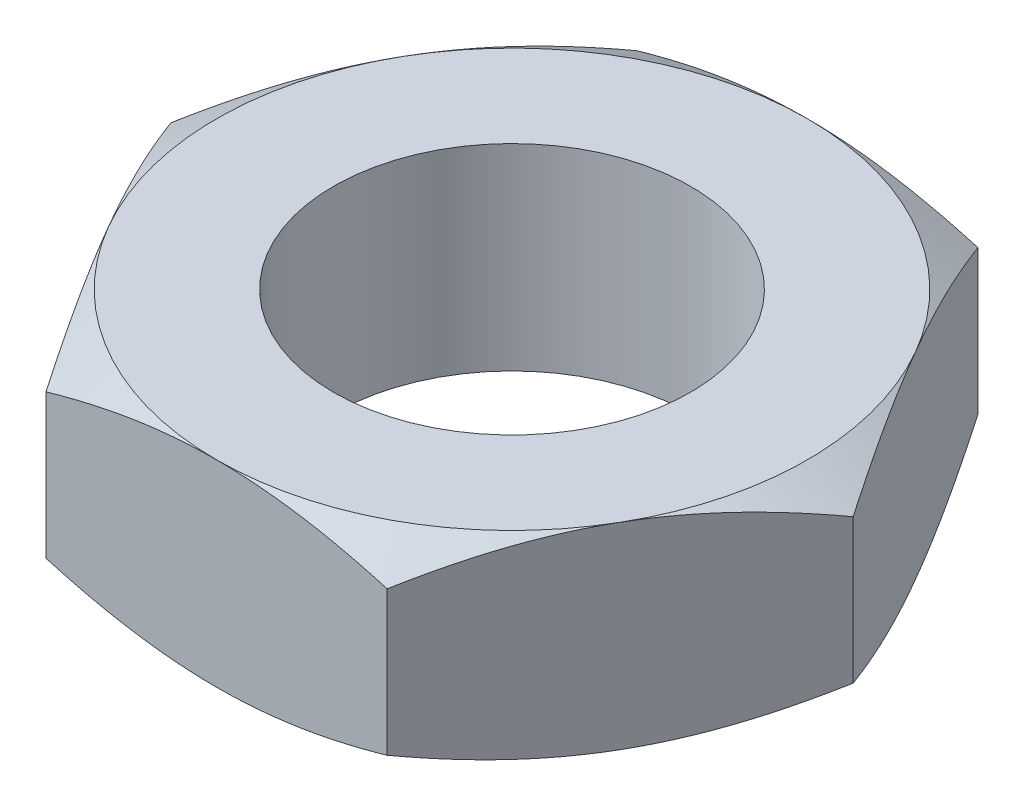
from build123d import *

# Parameters (mm, degrees)
EXTRUDE1_DEPTH         = 8
M12X1_5_TAPPED_HOLE1_D = 14.5


with BuildPart() as part:
    # Sketch1 → Extrude1 (new body)
    with BuildSketch(Plane(origin=(0, 0, 0), x_dir=(1, 0, 0), z_dir=(0, 1, 0))):
        Polygon((6.92820323, -12), (13.856406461, 0), (6.92820323, 12), (-6.92820323, 12), (-13.856406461, 0), (-6.92820323, -12), align=None)
    extrude(amount=EXTRUDE1_DEPTH)

    # Sketch2 → Cut-Revolve1 (revolve, cut)
    with BuildSketch(Plane(origin=(0, 0, 0), x_dir=(0, 0, -1), z_dir=(1, 0, 0))):
        Polygon((-12, 8), (-17.196152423, 5), (-17.196152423, 8), align=None)
        Polygon((-17.196152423, 0), (-12, 0), (-17.196152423, 3), align=None)
    revolve(axis=Axis((0, 0, 0), (0, 1, 0)), mode=Mode.SUBTRACT)

    # M12x1.5 Tapped Hole1 (through all)
    with Locations(Plane(origin=(0, 8, 0), x_dir=(-1, 0, 0), z_dir=(0, 1, 0))):
        with Locations((0, 0)):
            Hole(M12X1_5_TAPPED_HOLE1_D / 2)


solid = part.part
